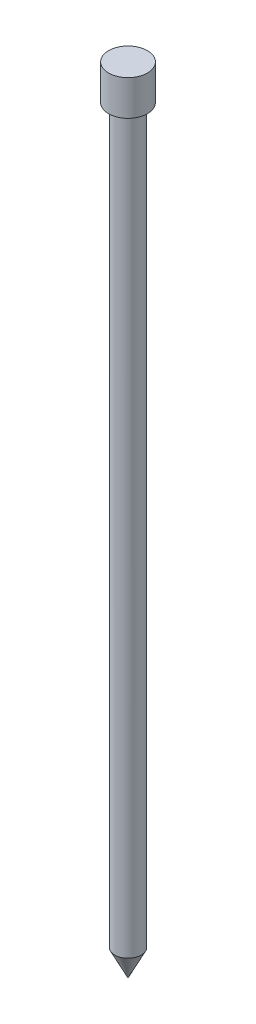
ISO-10303-21;
HEADER;
FILE_DESCRIPTION(('STEP AP214'),'2;1');
FILE_NAME('part.step','',(''),(''),'','','');
FILE_SCHEMA(('AUTOMOTIVE_DESIGN { 1 0 10303 214 1 1 1 1 }'));
ENDSEC;
DATA;
#1=APPLICATION_CONTEXT('core data for automotive mechanical design processes');
#2=APPLICATION_PROTOCOL_DEFINITION('international standard','automotive_design',2000,#1);
#3=PRODUCT_CONTEXT('',#1,'mechanical');
#4=PRODUCT('Part','Part','',(#3));
#5=PRODUCT_RELATED_PRODUCT_CATEGORY('part','',(#4));
#6=PRODUCT_DEFINITION_FORMATION('','',#4);
#7=PRODUCT_DEFINITION_CONTEXT('part definition',#1,'design');
#8=PRODUCT_DEFINITION('design','',#6,#7);
#9=PRODUCT_DEFINITION_SHAPE('','',#8);
#10=(LENGTH_UNIT() NAMED_UNIT(*) SI_UNIT(.MILLI.,.METRE.));
#11=(NAMED_UNIT(*) PLANE_ANGLE_UNIT() SI_UNIT($,.RADIAN.));
#12=(NAMED_UNIT(*) SI_UNIT($,.STERADIAN.) SOLID_ANGLE_UNIT());
#13=UNCERTAINTY_MEASURE_WITH_UNIT(LENGTH_MEASURE(1.E-05),#10,'distance_accuracy_value','');
#14=(GEOMETRIC_REPRESENTATION_CONTEXT(3) GLOBAL_UNCERTAINTY_ASSIGNED_CONTEXT((#13)) GLOBAL_UNIT_ASSIGNED_CONTEXT((#10,
#11,#12)) REPRESENTATION_CONTEXT('',''));
#15=CARTESIAN_POINT('',(0.,0.,0.));
#16=DIRECTION('',(0.,0.,1.));
#17=DIRECTION('',(1.,0.,0.));
#18=AXIS2_PLACEMENT_3D('',#15,#16,#17);
#19=CARTESIAN_POINT('',(-1.09999999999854,45.,0.));
#20=DIRECTION('',(0.,-1.,0.));
#21=DIRECTION('',(0.,0.,-1.));
#22=AXIS2_PLACEMENT_3D('',#19,#20,#21);
#23=PLANE('',#22);
#24=CARTESIAN_POINT('',(0.,45.,0.));
#25=DIRECTION('',(0.,-1.,0.));
#26=DIRECTION('',(0.,0.,-1.));
#27=AXIS2_PLACEMENT_3D('',#24,#25,#26);
#28=CIRCLE('',#27,1.09999999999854);
#29=CARTESIAN_POINT('',(0.,45.,-1.09999999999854));
#30=VERTEX_POINT('',#29);
#31=EDGE_CURVE('E11',#30,#30,#28,.T.);
#32=ORIENTED_EDGE('',*,*,#31,.F.);
#33=EDGE_LOOP('',(#32));
#34=FACE_BOUND('',#33,.T.);
#35=ADVANCED_FACE('F32',(#34),#23,.F.);
#36=CARTESIAN_POINT('',(0.,0.,0.));
#37=DIRECTION('',(0.,-1.,0.));
#38=DIRECTION('',(0.,0.,-1.));
#39=AXIS2_PLACEMENT_3D('',#36,#37,#38);
#40=CYLINDRICAL_SURFACE('',#39,1.09999999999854);
#41=CARTESIAN_POINT('',(0.,43.,0.));
#42=DIRECTION('',(0.,-1.,0.));
#43=DIRECTION('',(0.,0.,-1.));
#44=AXIS2_PLACEMENT_3D('',#41,#42,#43);
#45=CIRCLE('',#44,1.09999999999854);
#46=CARTESIAN_POINT('',(0.,43.,-1.09999999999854));
#47=VERTEX_POINT('',#46);
#48=EDGE_CURVE('E38',#47,#47,#45,.T.);
#49=ORIENTED_EDGE('',*,*,#48,.F.);
#50=EDGE_LOOP('',(#49));
#51=FACE_BOUND('',#50,.T.);
#52=ORIENTED_EDGE('',*,*,#31,.T.);
#53=EDGE_LOOP('',(#52));
#54=FACE_BOUND('',#53,.T.);
#55=ADVANCED_FACE('F59',(#51,#54),#40,.T.);
#56=CARTESIAN_POINT('',(-1.09999999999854,43.,0.));
#57=DIRECTION('',(0.,1.,0.));
#58=DIRECTION('',(0.,0.,1.));
#59=AXIS2_PLACEMENT_3D('',#56,#57,#58);
#60=PLANE('',#59);
#61=CARTESIAN_POINT('',(0.,43.,0.));
#62=DIRECTION('',(0.,-1.,0.));
#63=DIRECTION('',(0.,0.,-1.));
#64=AXIS2_PLACEMENT_3D('',#61,#62,#63);
#65=CIRCLE('',#64,0.75);
#66=CARTESIAN_POINT('',(0.,43.,-0.75));
#67=VERTEX_POINT('',#66);
#68=EDGE_CURVE('E50',#67,#67,#65,.T.);
#69=ORIENTED_EDGE('',*,*,#68,.F.);
#70=EDGE_LOOP('',(#69));
#71=FACE_BOUND('',#70,.T.);
#72=ORIENTED_EDGE('',*,*,#48,.T.);
#73=EDGE_LOOP('',(#72));
#74=FACE_BOUND('',#73,.T.);
#75=ADVANCED_FACE('F57',(#71,#74),#60,.F.);
#76=CARTESIAN_POINT('',(0.,0.,0.));
#77=DIRECTION('',(0.,-1.,0.));
#78=DIRECTION('',(0.,0.,-1.));
#79=AXIS2_PLACEMENT_3D('',#76,#77,#78);
#80=CYLINDRICAL_SURFACE('',#79,0.75);
#81=CARTESIAN_POINT('',(0.,1.5,0.));
#82=DIRECTION('',(0.,-1.,0.));
#83=DIRECTION('',(0.,0.,-1.));
#84=AXIS2_PLACEMENT_3D('',#81,#82,#83);
#85=CIRCLE('',#84,0.75);
#86=CARTESIAN_POINT('',(0.,1.5,-0.75));
#87=VERTEX_POINT('',#86);
#88=EDGE_CURVE('E48',#87,#87,#85,.T.);
#89=ORIENTED_EDGE('',*,*,#88,.F.);
#90=EDGE_LOOP('',(#89));
#91=FACE_BOUND('',#90,.T.);
#92=ORIENTED_EDGE('',*,*,#68,.T.);
#93=EDGE_LOOP('',(#92));
#94=FACE_BOUND('',#93,.T.);
#95=ADVANCED_FACE('F44',(#91,#94),#80,.T.);
#96=CARTESIAN_POINT('',(0.,1.5,0.));
#97=DIRECTION('',(0.,1.,0.));
#98=DIRECTION('',(0.,0.,1.));
#99=AXIS2_PLACEMENT_3D('',#96,#97,#98);
#100=CONICAL_SURFACE('',#99,0.75,0.463647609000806);
#101=CARTESIAN_POINT('',(0.,0.,0.));
#102=VERTEX_POINT('',#101);
#103=VERTEX_LOOP('',#102);
#104=FACE_BOUND('',#103,.T.);
#105=ORIENTED_EDGE('',*,*,#88,.T.);
#106=EDGE_LOOP('',(#105));
#107=FACE_BOUND('',#106,.T.);
#108=ADVANCED_FACE('F41',(#104,#107),#100,.T.);
#109=CLOSED_SHELL('',(#35,#55,#75,#95,#108));
#110=MANIFOLD_SOLID_BREP('B2',#109);
#111=ADVANCED_BREP_SHAPE_REPRESENTATION('',(#18,#110),#14);
#112=SHAPE_DEFINITION_REPRESENTATION(#9,#111);
ENDSEC;
END-ISO-10303-21;
